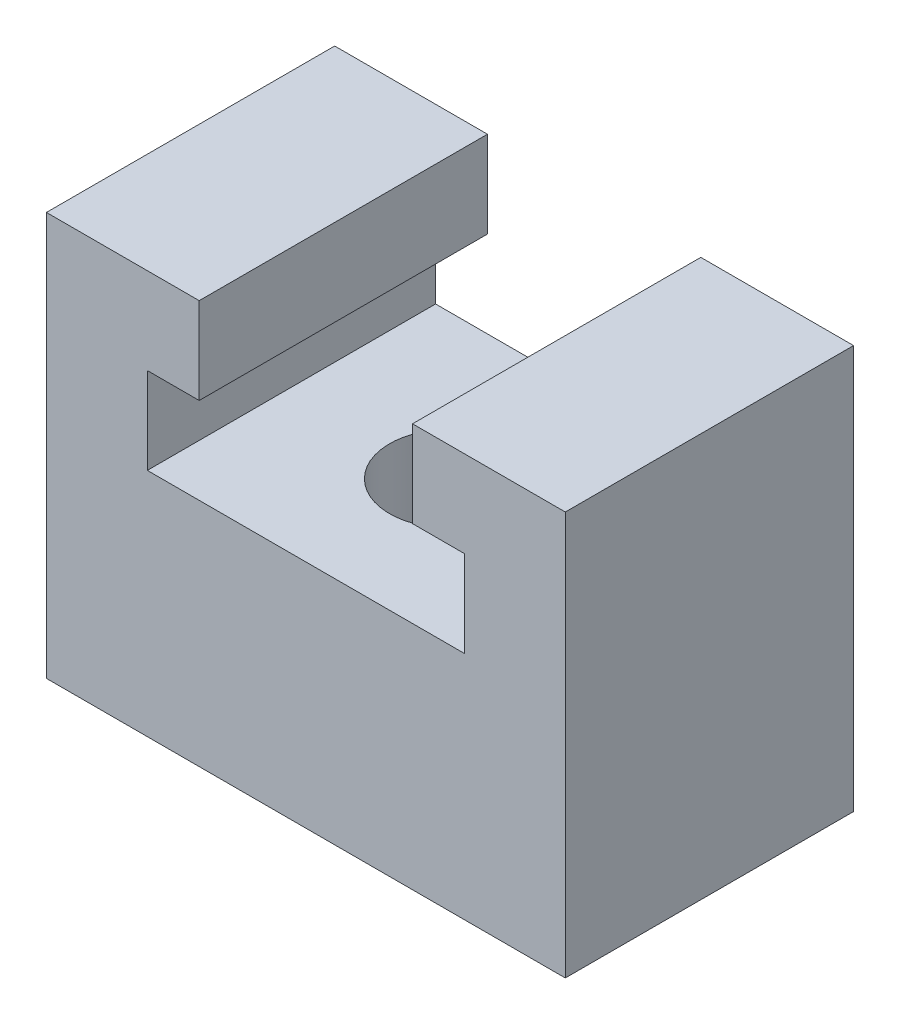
ISO-10303-21;
HEADER;
FILE_DESCRIPTION(('STEP AP214'),'2;1');
FILE_NAME('part.step','',(''),(''),'','','');
FILE_SCHEMA(('AUTOMOTIVE_DESIGN { 1 0 10303 214 1 1 1 1 }'));
ENDSEC;
DATA;
#1=APPLICATION_CONTEXT('core data for automotive mechanical design processes');
#2=APPLICATION_PROTOCOL_DEFINITION('international standard','automotive_design',2000,#1);
#3=PRODUCT_CONTEXT('',#1,'mechanical');
#4=PRODUCT('Part','Part','',(#3));
#5=PRODUCT_RELATED_PRODUCT_CATEGORY('part','',(#4));
#6=PRODUCT_DEFINITION_FORMATION('','',#4);
#7=PRODUCT_DEFINITION_CONTEXT('part definition',#1,'design');
#8=PRODUCT_DEFINITION('design','',#6,#7);
#9=PRODUCT_DEFINITION_SHAPE('','',#8);
#10=(LENGTH_UNIT() NAMED_UNIT(*) SI_UNIT(.MILLI.,.METRE.));
#11=(NAMED_UNIT(*) PLANE_ANGLE_UNIT() SI_UNIT($,.RADIAN.));
#12=(NAMED_UNIT(*) SI_UNIT($,.STERADIAN.) SOLID_ANGLE_UNIT());
#13=UNCERTAINTY_MEASURE_WITH_UNIT(LENGTH_MEASURE(1.E-05),#10,'distance_accuracy_value','');
#14=(GEOMETRIC_REPRESENTATION_CONTEXT(3) GLOBAL_UNCERTAINTY_ASSIGNED_CONTEXT((#13)) GLOBAL_UNIT_ASSIGNED_CONTEXT((#10,
#11,#12)) REPRESENTATION_CONTEXT('',''));
#15=CARTESIAN_POINT('',(0.,0.,0.));
#16=DIRECTION('',(0.,0.,1.));
#17=DIRECTION('',(1.,0.,0.));
#18=AXIS2_PLACEMENT_3D('',#15,#16,#17);
#19=CARTESIAN_POINT('',(0.,14.,0.));
#20=DIRECTION('',(0.,-1.,0.));
#21=DIRECTION('',(0.,0.,-1.));
#22=AXIS2_PLACEMENT_3D('',#19,#20,#21);
#23=PLANE('',#22);
#24=DIRECTION('',(1.,0.,0.));
#25=VECTOR('',#24,1.);
#26=CARTESIAN_POINT('',(0.,14.,0.));
#27=LINE('',#26,#25);
#28=CARTESIAN_POINT('',(0.,14.,0.));
#29=VERTEX_POINT('',#28);
#30=CARTESIAN_POINT('',(5.3,14.,0.));
#31=VERTEX_POINT('',#30);
#32=EDGE_CURVE('E70',#29,#31,#27,.T.);
#33=ORIENTED_EDGE('',*,*,#32,.T.);
#34=DIRECTION('',(0.,0.,-1.));
#35=VECTOR('',#34,1.);
#36=CARTESIAN_POINT('',(5.3,14.,0.));
#37=LINE('',#36,#35);
#38=CARTESIAN_POINT('',(5.3,14.,-10.));
#39=VERTEX_POINT('',#38);
#40=EDGE_CURVE('E201',#31,#39,#37,.T.);
#41=ORIENTED_EDGE('',*,*,#40,.T.);
#42=DIRECTION('',(-1.,0.,0.));
#43=VECTOR('',#42,1.);
#44=CARTESIAN_POINT('',(0.,14.,-10.));
#45=LINE('',#44,#43);
#46=CARTESIAN_POINT('',(0.,14.,-10.));
#47=VERTEX_POINT('',#46);
#48=EDGE_CURVE('E40',#39,#47,#45,.T.);
#49=ORIENTED_EDGE('',*,*,#48,.T.);
#50=DIRECTION('',(0.,0.,1.));
#51=VECTOR('',#50,1.);
#52=CARTESIAN_POINT('',(0.,14.,0.));
#53=LINE('',#52,#51);
#54=EDGE_CURVE('E173',#47,#29,#53,.T.);
#55=ORIENTED_EDGE('',*,*,#54,.T.);
#56=EDGE_LOOP('',(#33,#41,#49,#55));
#57=FACE_BOUND('',#56,.T.);
#58=ADVANCED_FACE('F16',(#57),#23,.F.);
#59=CARTESIAN_POINT('',(0.,14.,0.));
#60=DIRECTION('',(1.,0.,0.));
#61=DIRECTION('',(0.,0.,-1.));
#62=AXIS2_PLACEMENT_3D('',#59,#60,#61);
#63=PLANE('',#62);
#64=DIRECTION('',(0.,0.,1.));
#65=VECTOR('',#64,1.);
#66=CARTESIAN_POINT('',(0.,0.,0.));
#67=LINE('',#66,#65);
#68=CARTESIAN_POINT('',(0.,0.,-10.));
#69=VERTEX_POINT('',#68);
#70=CARTESIAN_POINT('',(0.,0.,0.));
#71=VERTEX_POINT('',#70);
#72=EDGE_CURVE('E172',#69,#71,#67,.T.);
#73=ORIENTED_EDGE('',*,*,#72,.T.);
#74=DIRECTION('',(0.,-1.,0.));
#75=VECTOR('',#74,1.);
#76=CARTESIAN_POINT('',(0.,14.,0.));
#77=LINE('',#76,#75);
#78=EDGE_CURVE('E195',#29,#71,#77,.T.);
#79=ORIENTED_EDGE('',*,*,#78,.F.);
#80=ORIENTED_EDGE('',*,*,#54,.F.);
#81=DIRECTION('',(0.,-1.,0.));
#82=VECTOR('',#81,1.);
#83=CARTESIAN_POINT('',(0.,14.,-10.));
#84=LINE('',#83,#82);
#85=EDGE_CURVE('E181',#47,#69,#84,.T.);
#86=ORIENTED_EDGE('',*,*,#85,.T.);
#87=EDGE_LOOP('',(#73,#79,#80,#86));
#88=FACE_BOUND('',#87,.T.);
#89=ADVANCED_FACE('F18',(#88),#63,.F.);
#90=CARTESIAN_POINT('',(0.,14.,0.));
#91=DIRECTION('',(0.,0.,-1.));
#92=DIRECTION('',(-1.,0.,0.));
#93=AXIS2_PLACEMENT_3D('',#90,#91,#92);
#94=PLANE('',#93);
#95=DIRECTION('',(-1.,0.,0.));
#96=VECTOR('',#95,1.);
#97=CARTESIAN_POINT('',(5.3,11.,0.));
#98=LINE('',#97,#96);
#99=CARTESIAN_POINT('',(5.3,11.,0.));
#100=VERTEX_POINT('',#99);
#101=CARTESIAN_POINT('',(3.5,11.,0.));
#102=VERTEX_POINT('',#101);
#103=EDGE_CURVE('E141',#100,#102,#98,.T.);
#104=ORIENTED_EDGE('',*,*,#103,.F.);
#105=DIRECTION('',(0.,-1.,0.));
#106=VECTOR('',#105,1.);
#107=CARTESIAN_POINT('',(5.3,14.,0.));
#108=LINE('',#107,#106);
#109=EDGE_CURVE('E138',#31,#100,#108,.T.);
#110=ORIENTED_EDGE('',*,*,#109,.F.);
#111=ORIENTED_EDGE('',*,*,#32,.F.);
#112=ORIENTED_EDGE('',*,*,#78,.T.);
#113=DIRECTION('',(1.,0.,0.));
#114=VECTOR('',#113,1.);
#115=CARTESIAN_POINT('',(0.,0.,0.));
#116=LINE('',#115,#114);
#117=CARTESIAN_POINT('',(18.,0.,0.));
#118=VERTEX_POINT('',#117);
#119=EDGE_CURVE('E184',#71,#118,#116,.T.);
#120=ORIENTED_EDGE('',*,*,#119,.T.);
#121=DIRECTION('',(0.,-1.,0.));
#122=VECTOR('',#121,1.);
#123=CARTESIAN_POINT('',(18.,14.,0.));
#124=LINE('',#123,#122);
#125=CARTESIAN_POINT('',(18.,14.,0.));
#126=VERTEX_POINT('',#125);
#127=EDGE_CURVE('E192',#126,#118,#124,.T.);
#128=ORIENTED_EDGE('',*,*,#127,.F.);
#129=CARTESIAN_POINT('',(12.7,14.,0.));
#130=VERTEX_POINT('',#129);
#131=EDGE_CURVE('E137',#130,#126,#27,.T.);
#132=ORIENTED_EDGE('',*,*,#131,.F.);
#133=DIRECTION('',(0.,1.,0.));
#134=VECTOR('',#133,1.);
#135=CARTESIAN_POINT('',(12.7,14.,0.));
#136=LINE('',#135,#134);
#137=CARTESIAN_POINT('',(12.7,11.,0.));
#138=VERTEX_POINT('',#137);
#139=EDGE_CURVE('E31',#138,#130,#136,.T.);
#140=ORIENTED_EDGE('',*,*,#139,.F.);
#141=DIRECTION('',(-1.,0.,0.));
#142=VECTOR('',#141,1.);
#143=CARTESIAN_POINT('',(12.7,11.,0.));
#144=LINE('',#143,#142);
#145=CARTESIAN_POINT('',(14.5,11.,0.));
#146=VERTEX_POINT('',#145);
#147=EDGE_CURVE('E126',#146,#138,#144,.T.);
#148=ORIENTED_EDGE('',*,*,#147,.F.);
#149=DIRECTION('',(0.,1.,0.));
#150=VECTOR('',#149,1.);
#151=CARTESIAN_POINT('',(14.5,11.,0.));
#152=LINE('',#151,#150);
#153=CARTESIAN_POINT('',(14.5,8.,0.));
#154=VERTEX_POINT('',#153);
#155=EDGE_CURVE('E123',#154,#146,#152,.T.);
#156=ORIENTED_EDGE('',*,*,#155,.F.);
#157=DIRECTION('',(1.,0.,0.));
#158=VECTOR('',#157,1.);
#159=CARTESIAN_POINT('',(3.5,8.,0.));
#160=LINE('',#159,#158);
#161=CARTESIAN_POINT('',(3.5,8.,0.));
#162=VERTEX_POINT('',#161);
#163=EDGE_CURVE('E149',#162,#154,#160,.T.);
#164=ORIENTED_EDGE('',*,*,#163,.F.);
#165=DIRECTION('',(0.,-1.,0.));
#166=VECTOR('',#165,1.);
#167=CARTESIAN_POINT('',(3.5,11.,0.));
#168=LINE('',#167,#166);
#169=EDGE_CURVE('E146',#102,#162,#168,.T.);
#170=ORIENTED_EDGE('',*,*,#169,.F.);
#171=EDGE_LOOP('',(#104,#110,#111,#112,#120,#128,#132,#140,#148,#156,#164,#170));
#172=FACE_BOUND('',#171,.T.);
#173=ADVANCED_FACE('F135',(#172),#94,.F.);
#174=CARTESIAN_POINT('',(18.,14.,0.));
#175=DIRECTION('',(-1.,0.,0.));
#176=DIRECTION('',(0.,0.,1.));
#177=AXIS2_PLACEMENT_3D('',#174,#175,#176);
#178=PLANE('',#177);
#179=DIRECTION('',(0.,0.,-1.));
#180=VECTOR('',#179,1.);
#181=CARTESIAN_POINT('',(18.,0.,0.));
#182=LINE('',#181,#180);
#183=CARTESIAN_POINT('',(18.,0.,-10.));
#184=VERTEX_POINT('',#183);
#185=EDGE_CURVE('E186',#118,#184,#182,.T.);
#186=ORIENTED_EDGE('',*,*,#185,.T.);
#187=DIRECTION('',(0.,-1.,0.));
#188=VECTOR('',#187,1.);
#189=CARTESIAN_POINT('',(18.,14.,-10.));
#190=LINE('',#189,#188);
#191=CARTESIAN_POINT('',(18.,14.,-10.));
#192=VERTEX_POINT('',#191);
#193=EDGE_CURVE('E190',#192,#184,#190,.T.);
#194=ORIENTED_EDGE('',*,*,#193,.F.);
#195=DIRECTION('',(0.,0.,-1.));
#196=VECTOR('',#195,1.);
#197=CARTESIAN_POINT('',(18.,14.,0.));
#198=LINE('',#197,#196);
#199=EDGE_CURVE('E176',#126,#192,#198,.T.);
#200=ORIENTED_EDGE('',*,*,#199,.F.);
#201=ORIENTED_EDGE('',*,*,#127,.T.);
#202=EDGE_LOOP('',(#186,#194,#200,#201));
#203=FACE_BOUND('',#202,.T.);
#204=ADVANCED_FACE('F229',(#203),#178,.F.);
#205=CARTESIAN_POINT('',(0.,14.,-10.));
#206=DIRECTION('',(0.,0.,1.));
#207=DIRECTION('',(1.,0.,0.));
#208=AXIS2_PLACEMENT_3D('',#205,#206,#207);
#209=PLANE('',#208);
#210=ORIENTED_EDGE('',*,*,#48,.F.);
#211=DIRECTION('',(0.,-1.,0.));
#212=VECTOR('',#211,1.);
#213=CARTESIAN_POINT('',(5.3,14.,-10.));
#214=LINE('',#213,#212);
#215=CARTESIAN_POINT('',(5.3,11.,-10.));
#216=VERTEX_POINT('',#215);
#217=EDGE_CURVE('E166',#39,#216,#214,.T.);
#218=ORIENTED_EDGE('',*,*,#217,.T.);
#219=DIRECTION('',(-1.,0.,0.));
#220=VECTOR('',#219,1.);
#221=CARTESIAN_POINT('',(0.,11.,-10.));
#222=LINE('',#221,#220);
#223=CARTESIAN_POINT('',(3.5,11.,-10.));
#224=VERTEX_POINT('',#223);
#225=EDGE_CURVE('E11',#216,#224,#222,.T.);
#226=ORIENTED_EDGE('',*,*,#225,.T.);
#227=DIRECTION('',(0.,-1.,0.));
#228=VECTOR('',#227,1.);
#229=CARTESIAN_POINT('',(3.5,14.,-10.));
#230=LINE('',#229,#228);
#231=CARTESIAN_POINT('',(3.5,8.,-10.));
#232=VERTEX_POINT('',#231);
#233=EDGE_CURVE('E24',#224,#232,#230,.T.);
#234=ORIENTED_EDGE('',*,*,#233,.T.);
#235=DIRECTION('',(1.,0.,0.));
#236=VECTOR('',#235,1.);
#237=CARTESIAN_POINT('',(0.,8.,-10.));
#238=LINE('',#237,#236);
#239=CARTESIAN_POINT('',(14.5,8.,-10.));
#240=VERTEX_POINT('',#239);
#241=EDGE_CURVE('E162',#232,#240,#238,.T.);
#242=ORIENTED_EDGE('',*,*,#241,.T.);
#243=DIRECTION('',(0.,1.,0.));
#244=VECTOR('',#243,1.);
#245=CARTESIAN_POINT('',(14.5,14.,-10.));
#246=LINE('',#245,#244);
#247=CARTESIAN_POINT('',(14.5,11.,-10.));
#248=VERTEX_POINT('',#247);
#249=EDGE_CURVE('E205',#240,#248,#246,.T.);
#250=ORIENTED_EDGE('',*,*,#249,.T.);
#251=DIRECTION('',(-1.,0.,0.));
#252=VECTOR('',#251,1.);
#253=CARTESIAN_POINT('',(0.,11.,-10.));
#254=LINE('',#253,#252);
#255=CARTESIAN_POINT('',(12.7,11.,-10.));
#256=VERTEX_POINT('',#255);
#257=EDGE_CURVE('E203',#248,#256,#254,.T.);
#258=ORIENTED_EDGE('',*,*,#257,.T.);
#259=DIRECTION('',(0.,1.,0.));
#260=VECTOR('',#259,1.);
#261=CARTESIAN_POINT('',(12.7,14.,-10.));
#262=LINE('',#261,#260);
#263=CARTESIAN_POINT('',(12.7,14.,-10.));
#264=VERTEX_POINT('',#263);
#265=EDGE_CURVE('E119',#256,#264,#262,.T.);
#266=ORIENTED_EDGE('',*,*,#265,.T.);
#267=EDGE_CURVE('E178',#192,#264,#45,.T.);
#268=ORIENTED_EDGE('',*,*,#267,.F.);
#269=ORIENTED_EDGE('',*,*,#193,.T.);
#270=DIRECTION('',(-1.,0.,0.));
#271=VECTOR('',#270,1.);
#272=CARTESIAN_POINT('',(0.,0.,-10.));
#273=LINE('',#272,#271);
#274=EDGE_CURVE('E62',#184,#69,#273,.T.);
#275=ORIENTED_EDGE('',*,*,#274,.T.);
#276=ORIENTED_EDGE('',*,*,#85,.F.);
#277=EDGE_LOOP('',(#210,#218,#226,#234,#242,#250,#258,#266,#268,#269,#275,#276));
#278=FACE_BOUND('',#277,.T.);
#279=ADVANCED_FACE('F208',(#278),#209,.F.);
#280=ORIENTED_EDGE('',*,*,#267,.T.);
#281=DIRECTION('',(0.,0.,1.));
#282=VECTOR('',#281,1.);
#283=CARTESIAN_POINT('',(12.7,14.,0.));
#284=LINE('',#283,#282);
#285=EDGE_CURVE('E197',#264,#130,#284,.T.);
#286=ORIENTED_EDGE('',*,*,#285,.T.);
#287=ORIENTED_EDGE('',*,*,#131,.T.);
#288=ORIENTED_EDGE('',*,*,#199,.T.);
#289=EDGE_LOOP('',(#280,#286,#287,#288));
#290=FACE_BOUND('',#289,.T.);
#291=ADVANCED_FACE('F225',(#290),#23,.F.);
#292=CARTESIAN_POINT('',(0.,0.,0.));
#293=DIRECTION('',(0.,-1.,0.));
#294=DIRECTION('',(0.,0.,-1.));
#295=AXIS2_PLACEMENT_3D('',#292,#293,#294);
#296=PLANE('',#295);
#297=CARTESIAN_POINT('',(9.,0.,-5.));
#298=DIRECTION('',(0.,-1.,0.));
#299=DIRECTION('',(0.,0.,-1.));
#300=AXIS2_PLACEMENT_3D('',#297,#298,#299);
#301=CIRCLE('',#300,2.1);
#302=CARTESIAN_POINT('',(9.,0.,-7.1));
#303=VERTEX_POINT('',#302);
#304=EDGE_CURVE('E169',#303,#303,#301,.T.);
#305=ORIENTED_EDGE('',*,*,#304,.F.);
#306=EDGE_LOOP('',(#305));
#307=FACE_BOUND('',#306,.T.);
#308=ORIENTED_EDGE('',*,*,#72,.F.);
#309=ORIENTED_EDGE('',*,*,#274,.F.);
#310=ORIENTED_EDGE('',*,*,#185,.F.);
#311=ORIENTED_EDGE('',*,*,#119,.F.);
#312=EDGE_LOOP('',(#308,#309,#310,#311));
#313=FACE_BOUND('',#312,.T.);
#314=ADVANCED_FACE('F233',(#307,#313),#296,.T.);
#315=CARTESIAN_POINT('',(9.,0.,-5.));
#316=DIRECTION('',(0.,-1.,0.));
#317=DIRECTION('',(0.,0.,-1.));
#318=AXIS2_PLACEMENT_3D('',#315,#316,#317);
#319=CYLINDRICAL_SURFACE('',#318,2.1);
#320=CARTESIAN_POINT('',(9.,8.,-5.));
#321=DIRECTION('',(0.,-1.,0.));
#322=DIRECTION('',(1.,0.,0.));
#323=AXIS2_PLACEMENT_3D('',#320,#321,#322);
#324=CIRCLE('',#323,2.1);
#325=CARTESIAN_POINT('',(11.1,8.,-5.));
#326=VERTEX_POINT('',#325);
#327=EDGE_CURVE('E154',#326,#326,#324,.F.);
#328=ORIENTED_EDGE('',*,*,#327,.T.);
#329=EDGE_LOOP('',(#328));
#330=FACE_BOUND('',#329,.T.);
#331=ORIENTED_EDGE('',*,*,#304,.T.);
#332=EDGE_LOOP('',(#331));
#333=FACE_BOUND('',#332,.T.);
#334=ADVANCED_FACE('F254',(#330,#333),#319,.F.);
#335=CARTESIAN_POINT('',(12.7,11.,-12.));
#336=DIRECTION('',(0.,1.,0.));
#337=DIRECTION('',(0.,0.,1.));
#338=AXIS2_PLACEMENT_3D('',#335,#336,#337);
#339=PLANE('',#338);
#340=DIRECTION('',(0.,0.,1.));
#341=VECTOR('',#340,1.);
#342=CARTESIAN_POINT('',(14.5,11.,-12.));
#343=LINE('',#342,#341);
#344=EDGE_CURVE('E129',#248,#146,#343,.T.);
#345=ORIENTED_EDGE('',*,*,#344,.T.);
#346=ORIENTED_EDGE('',*,*,#147,.T.);
#347=DIRECTION('',(0.,0.,1.));
#348=VECTOR('',#347,1.);
#349=CARTESIAN_POINT('',(12.7,11.,-12.));
#350=LINE('',#349,#348);
#351=EDGE_CURVE('E115',#256,#138,#350,.T.);
#352=ORIENTED_EDGE('',*,*,#351,.F.);
#353=ORIENTED_EDGE('',*,*,#257,.F.);
#354=EDGE_LOOP('',(#345,#346,#352,#353));
#355=FACE_BOUND('',#354,.T.);
#356=ADVANCED_FACE('F127',(#355),#339,.F.);
#357=CARTESIAN_POINT('',(14.5,11.,-12.));
#358=DIRECTION('',(1.,0.,0.));
#359=DIRECTION('',(0.,1.,0.));
#360=AXIS2_PLACEMENT_3D('',#357,#358,#359);
#361=PLANE('',#360);
#362=DIRECTION('',(0.,0.,1.));
#363=VECTOR('',#362,1.);
#364=CARTESIAN_POINT('',(14.5,8.,-12.));
#365=LINE('',#364,#363);
#366=EDGE_CURVE('E155',#240,#154,#365,.T.);
#367=ORIENTED_EDGE('',*,*,#366,.T.);
#368=ORIENTED_EDGE('',*,*,#155,.T.);
#369=ORIENTED_EDGE('',*,*,#344,.F.);
#370=ORIENTED_EDGE('',*,*,#249,.F.);
#371=EDGE_LOOP('',(#367,#368,#369,#370));
#372=FACE_BOUND('',#371,.T.);
#373=ADVANCED_FACE('F222',(#372),#361,.F.);
#374=CARTESIAN_POINT('',(3.5,11.,-12.));
#375=DIRECTION('',(-1.,0.,0.));
#376=DIRECTION('',(0.,0.,1.));
#377=AXIS2_PLACEMENT_3D('',#374,#375,#376);
#378=PLANE('',#377);
#379=DIRECTION('',(0.,0.,1.));
#380=VECTOR('',#379,1.);
#381=CARTESIAN_POINT('',(3.5,11.,-12.));
#382=LINE('',#381,#380);
#383=EDGE_CURVE('E159',#224,#102,#382,.T.);
#384=ORIENTED_EDGE('',*,*,#383,.T.);
#385=ORIENTED_EDGE('',*,*,#169,.T.);
#386=DIRECTION('',(0.,0.,1.));
#387=VECTOR('',#386,1.);
#388=CARTESIAN_POINT('',(3.5,8.,-12.));
#389=LINE('',#388,#387);
#390=EDGE_CURVE('E157',#232,#162,#389,.T.);
#391=ORIENTED_EDGE('',*,*,#390,.F.);
#392=ORIENTED_EDGE('',*,*,#233,.F.);
#393=EDGE_LOOP('',(#384,#385,#391,#392));
#394=FACE_BOUND('',#393,.T.);
#395=ADVANCED_FACE('F212',(#394),#378,.F.);
#396=CARTESIAN_POINT('',(5.3,11.,-12.));
#397=DIRECTION('',(0.,1.,0.));
#398=DIRECTION('',(0.,0.,1.));
#399=AXIS2_PLACEMENT_3D('',#396,#397,#398);
#400=PLANE('',#399);
#401=DIRECTION('',(0.,0.,1.));
#402=VECTOR('',#401,1.);
#403=CARTESIAN_POINT('',(5.3,11.,-12.));
#404=LINE('',#403,#402);
#405=EDGE_CURVE('E122',#216,#100,#404,.T.);
#406=ORIENTED_EDGE('',*,*,#405,.T.);
#407=ORIENTED_EDGE('',*,*,#103,.T.);
#408=ORIENTED_EDGE('',*,*,#383,.F.);
#409=ORIENTED_EDGE('',*,*,#225,.F.);
#410=EDGE_LOOP('',(#406,#407,#408,#409));
#411=FACE_BOUND('',#410,.T.);
#412=ADVANCED_FACE('F214',(#411),#400,.F.);
#413=CARTESIAN_POINT('',(5.3,14.,-12.));
#414=DIRECTION('',(-1.,0.,0.));
#415=DIRECTION('',(0.,-1.,0.));
#416=AXIS2_PLACEMENT_3D('',#413,#414,#415);
#417=PLANE('',#416);
#418=ORIENTED_EDGE('',*,*,#40,.F.);
#419=ORIENTED_EDGE('',*,*,#109,.T.);
#420=ORIENTED_EDGE('',*,*,#405,.F.);
#421=ORIENTED_EDGE('',*,*,#217,.F.);
#422=EDGE_LOOP('',(#418,#419,#420,#421));
#423=FACE_BOUND('',#422,.T.);
#424=ADVANCED_FACE('F238',(#423),#417,.F.);
#425=CARTESIAN_POINT('',(12.7,14.,-12.));
#426=DIRECTION('',(1.,0.,0.));
#427=DIRECTION('',(0.,1.,0.));
#428=AXIS2_PLACEMENT_3D('',#425,#426,#427);
#429=PLANE('',#428);
#430=ORIENTED_EDGE('',*,*,#351,.T.);
#431=ORIENTED_EDGE('',*,*,#139,.T.);
#432=ORIENTED_EDGE('',*,*,#285,.F.);
#433=ORIENTED_EDGE('',*,*,#265,.F.);
#434=EDGE_LOOP('',(#430,#431,#432,#433));
#435=FACE_BOUND('',#434,.T.);
#436=ADVANCED_FACE('F117',(#435),#429,.F.);
#437=CARTESIAN_POINT('',(3.5,8.,-12.));
#438=DIRECTION('',(0.,-1.,0.));
#439=DIRECTION('',(1.,0.,0.));
#440=AXIS2_PLACEMENT_3D('',#437,#438,#439);
#441=PLANE('',#440);
#442=ORIENTED_EDGE('',*,*,#327,.F.);
#443=EDGE_LOOP('',(#442));
#444=FACE_BOUND('',#443,.T.);
#445=ORIENTED_EDGE('',*,*,#390,.T.);
#446=ORIENTED_EDGE('',*,*,#163,.T.);
#447=ORIENTED_EDGE('',*,*,#366,.F.);
#448=ORIENTED_EDGE('',*,*,#241,.F.);
#449=EDGE_LOOP('',(#445,#446,#447,#448));
#450=FACE_BOUND('',#449,.T.);
#451=ADVANCED_FACE('F220',(#444,#450),#441,.F.);
#452=CLOSED_SHELL('',(#58,#89,#173,#204,#279,#291,#314,#334,#356,#373,#395,#412,#424,#436,#451));
#453=MANIFOLD_SOLID_BREP('B1',#452);
#454=ADVANCED_BREP_SHAPE_REPRESENTATION('',(#18,#453),#14);
#455=SHAPE_DEFINITION_REPRESENTATION(#9,#454);
ENDSEC;
END-ISO-10303-21;
